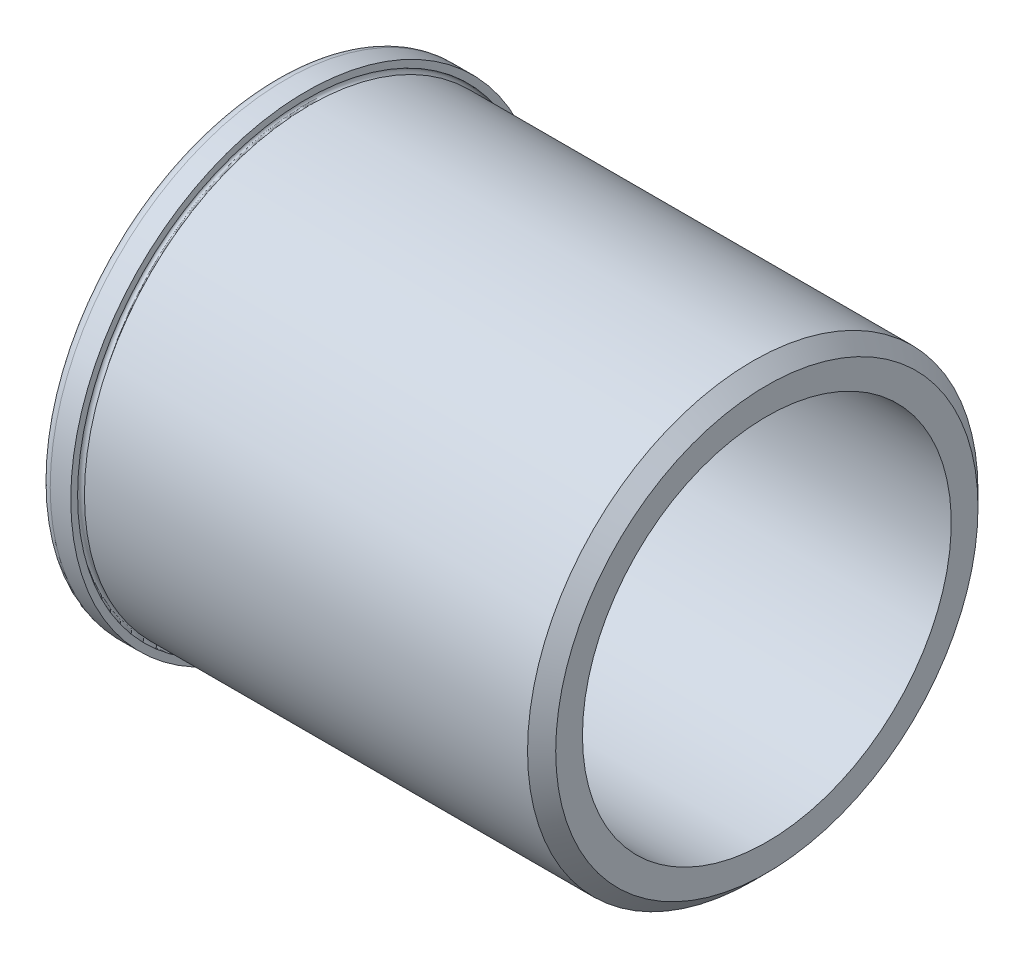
ISO-10303-21;
HEADER;
FILE_DESCRIPTION(('STEP AP214'),'2;1');
FILE_NAME('part.step','',(''),(''),'','','');
FILE_SCHEMA(('AUTOMOTIVE_DESIGN { 1 0 10303 214 1 1 1 1 }'));
ENDSEC;
DATA;
#1=APPLICATION_CONTEXT('core data for automotive mechanical design processes');
#2=APPLICATION_PROTOCOL_DEFINITION('international standard','automotive_design',2000,#1);
#3=PRODUCT_CONTEXT('',#1,'mechanical');
#4=PRODUCT('Part','Part','',(#3));
#5=PRODUCT_RELATED_PRODUCT_CATEGORY('part','',(#4));
#6=PRODUCT_DEFINITION_FORMATION('','',#4);
#7=PRODUCT_DEFINITION_CONTEXT('part definition',#1,'design');
#8=PRODUCT_DEFINITION('design','',#6,#7);
#9=PRODUCT_DEFINITION_SHAPE('','',#8);
#10=(LENGTH_UNIT() NAMED_UNIT(*) SI_UNIT(.MILLI.,.METRE.));
#11=(NAMED_UNIT(*) PLANE_ANGLE_UNIT() SI_UNIT($,.RADIAN.));
#12=(NAMED_UNIT(*) SI_UNIT($,.STERADIAN.) SOLID_ANGLE_UNIT());
#13=UNCERTAINTY_MEASURE_WITH_UNIT(LENGTH_MEASURE(1.E-05),#10,'distance_accuracy_value','');
#14=(GEOMETRIC_REPRESENTATION_CONTEXT(3) GLOBAL_UNCERTAINTY_ASSIGNED_CONTEXT((#13)) GLOBAL_UNIT_ASSIGNED_CONTEXT((#10,
#11,#12)) REPRESENTATION_CONTEXT('',''));
#15=CARTESIAN_POINT('',(0.,0.,0.));
#16=DIRECTION('',(0.,0.,1.));
#17=DIRECTION('',(1.,0.,0.));
#18=AXIS2_PLACEMENT_3D('',#15,#16,#17);
#19=CARTESIAN_POINT('',(4.7752,36.5125,0.));
#20=DIRECTION('',(1.,0.,0.));
#21=DIRECTION('',(0.,0.,-1.));
#22=AXIS2_PLACEMENT_3D('',#19,#20,#21);
#23=PLANE('',#22);
#24=CARTESIAN_POINT('',(4.7752,0.,0.));
#25=DIRECTION('',(-1.,0.,0.));
#26=DIRECTION('',(0.,0.,1.));
#27=AXIS2_PLACEMENT_3D('',#24,#25,#26);
#28=CIRCLE('',#27,35.4541666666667);
#29=CARTESIAN_POINT('',(4.7752,0.,35.4541666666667));
#30=VERTEX_POINT('',#29);
#31=EDGE_CURVE('E71',#30,#30,#28,.T.);
#32=ORIENTED_EDGE('',*,*,#31,.T.);
#33=EDGE_LOOP('',(#32));
#34=FACE_BOUND('',#33,.T.);
#35=CARTESIAN_POINT('',(4.7752,0.,0.));
#36=DIRECTION('',(-1.,0.,0.));
#37=DIRECTION('',(0.,0.,1.));
#38=AXIS2_PLACEMENT_3D('',#35,#36,#37);
#39=CIRCLE('',#38,36.5125);
#40=CARTESIAN_POINT('',(4.7752,0.,36.5125));
#41=VERTEX_POINT('',#40);
#42=EDGE_CURVE('E10',#41,#41,#39,.T.);
#43=ORIENTED_EDGE('',*,*,#42,.F.);
#44=EDGE_LOOP('',(#43));
#45=FACE_BOUND('',#44,.T.);
#46=ADVANCED_FACE('F37',(#34,#45),#23,.T.);
#47=CARTESIAN_POINT('',(0.,0.,0.));
#48=DIRECTION('',(-1.,0.,0.));
#49=DIRECTION('',(0.,0.,1.));
#50=AXIS2_PLACEMENT_3D('',#47,#48,#49);
#51=CYLINDRICAL_SURFACE('',#50,36.5125);
#52=ORIENTED_EDGE('',*,*,#42,.T.);
#53=EDGE_LOOP('',(#52));
#54=FACE_BOUND('',#53,.T.);
#55=CARTESIAN_POINT('',(1.58750000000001,0.,0.));
#56=DIRECTION('',(-1.,0.,0.));
#57=DIRECTION('',(0.,0.,1.));
#58=AXIS2_PLACEMENT_3D('',#55,#56,#57);
#59=CIRCLE('',#58,36.5125);
#60=CARTESIAN_POINT('',(1.58750000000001,0.,36.5125));
#61=VERTEX_POINT('',#60);
#62=EDGE_CURVE('E43',#61,#61,#59,.T.);
#63=ORIENTED_EDGE('',*,*,#62,.F.);
#64=EDGE_LOOP('',(#63));
#65=FACE_BOUND('',#64,.T.);
#66=ADVANCED_FACE('F89',(#54,#65),#51,.T.);
#67=CARTESIAN_POINT('',(1.5875,0.,0.));
#68=DIRECTION('',(-1.,0.,0.));
#69=DIRECTION('',(0.,0.,1.));
#70=AXIS2_PLACEMENT_3D('',#67,#68,#69);
#71=TOROIDAL_SURFACE('',#70,34.925,1.5875);
#72=CARTESIAN_POINT('',(0.,0.,0.));
#73=DIRECTION('',(-1.,0.,0.));
#74=DIRECTION('',(0.,0.,1.));
#75=AXIS2_PLACEMENT_3D('',#72,#73,#74);
#76=CIRCLE('',#75,34.925);
#77=CARTESIAN_POINT('',(0.,0.,34.925));
#78=VERTEX_POINT('',#77);
#79=EDGE_CURVE('E47',#78,#78,#76,.T.);
#80=ORIENTED_EDGE('',*,*,#79,.F.);
#81=EDGE_LOOP('',(#80));
#82=FACE_BOUND('',#81,.T.);
#83=ORIENTED_EDGE('',*,*,#62,.T.);
#84=EDGE_LOOP('',(#83));
#85=FACE_BOUND('',#84,.T.);
#86=ADVANCED_FACE('F93',(#82,#85),#71,.T.);
#87=CARTESIAN_POINT('',(0.,31.76905,0.));
#88=DIRECTION('',(-1.,0.,0.));
#89=DIRECTION('',(0.,0.,1.));
#90=AXIS2_PLACEMENT_3D('',#87,#88,#89);
#91=PLANE('',#90);
#92=ORIENTED_EDGE('',*,*,#79,.T.);
#93=EDGE_LOOP('',(#92));
#94=FACE_BOUND('',#93,.T.);
#95=CARTESIAN_POINT('',(0.,0.,0.));
#96=DIRECTION('',(-1.,0.,0.));
#97=DIRECTION('',(0.,0.,1.));
#98=AXIS2_PLACEMENT_3D('',#95,#96,#97);
#99=CIRCLE('',#98,31.76905);
#100=CARTESIAN_POINT('',(0.,0.,31.76905));
#101=VERTEX_POINT('',#100);
#102=EDGE_CURVE('E51',#101,#101,#99,.T.);
#103=ORIENTED_EDGE('',*,*,#102,.F.);
#104=EDGE_LOOP('',(#103));
#105=FACE_BOUND('',#104,.T.);
#106=ADVANCED_FACE('F97',(#94,#105),#91,.T.);
#107=CARTESIAN_POINT('',(3.175,0.,0.));
#108=DIRECTION('',(-1.,0.,0.));
#109=DIRECTION('',(0.,0.,1.));
#110=AXIS2_PLACEMENT_3D('',#107,#108,#109);
#111=TOROIDAL_SURFACE('',#110,31.76905,3.175);
#112=CARTESIAN_POINT('',(3.175,0.,0.));
#113=DIRECTION('',(-1.,0.,0.));
#114=DIRECTION('',(0.,0.,1.));
#115=AXIS2_PLACEMENT_3D('',#112,#113,#114);
#116=CIRCLE('',#115,28.59405);
#117=CARTESIAN_POINT('',(3.175,0.,28.59405));
#118=VERTEX_POINT('',#117);
#119=EDGE_CURVE('E56',#118,#118,#116,.T.);
#120=ORIENTED_EDGE('',*,*,#119,.F.);
#121=EDGE_LOOP('',(#120));
#122=FACE_BOUND('',#121,.T.);
#123=ORIENTED_EDGE('',*,*,#102,.T.);
#124=EDGE_LOOP('',(#123));
#125=FACE_BOUND('',#124,.T.);
#126=ADVANCED_FACE('F104',(#122,#125),#111,.T.);
#127=CARTESIAN_POINT('',(0.,0.,0.));
#128=DIRECTION('',(-1.,0.,0.));
#129=DIRECTION('',(0.,0.,1.));
#130=AXIS2_PLACEMENT_3D('',#127,#128,#129);
#131=CYLINDRICAL_SURFACE('',#130,28.59405);
#132=ORIENTED_EDGE('',*,*,#119,.T.);
#133=EDGE_LOOP('',(#132));
#134=FACE_BOUND('',#133,.T.);
#135=CARTESIAN_POINT('',(76.2,0.,0.));
#136=DIRECTION('',(-1.,0.,0.));
#137=DIRECTION('',(0.,0.,1.));
#138=AXIS2_PLACEMENT_3D('',#135,#136,#137);
#139=CIRCLE('',#138,28.59405);
#140=CARTESIAN_POINT('',(76.2,0.,28.59405));
#141=VERTEX_POINT('',#140);
#142=EDGE_CURVE('E59',#141,#141,#139,.T.);
#143=ORIENTED_EDGE('',*,*,#142,.F.);
#144=EDGE_LOOP('',(#143));
#145=FACE_BOUND('',#144,.T.);
#146=ADVANCED_FACE('F108',(#134,#145),#131,.F.);
#147=CARTESIAN_POINT('',(76.2,32.7421875,0.));
#148=DIRECTION('',(1.,0.,0.));
#149=DIRECTION('',(0.,0.,-1.));
#150=AXIS2_PLACEMENT_3D('',#147,#148,#149);
#151=PLANE('',#150);
#152=ORIENTED_EDGE('',*,*,#142,.T.);
#153=EDGE_LOOP('',(#152));
#154=FACE_BOUND('',#153,.T.);
#155=CARTESIAN_POINT('',(76.2,0.,0.));
#156=DIRECTION('',(-1.,0.,0.));
#157=DIRECTION('',(0.,0.,1.));
#158=AXIS2_PLACEMENT_3D('',#155,#156,#157);
#159=CIRCLE('',#158,32.7421875);
#160=CARTESIAN_POINT('',(76.2,0.,32.7421875));
#161=VERTEX_POINT('',#160);
#162=EDGE_CURVE('E62',#161,#161,#159,.T.);
#163=ORIENTED_EDGE('',*,*,#162,.F.);
#164=EDGE_LOOP('',(#163));
#165=FACE_BOUND('',#164,.T.);
#166=ADVANCED_FACE('F112',(#154,#165),#151,.T.);
#167=CARTESIAN_POINT('',(74.0171875,0.,0.));
#168=DIRECTION('',(-1.,0.,0.));
#169=DIRECTION('',(0.,0.,1.));
#170=AXIS2_PLACEMENT_3D('',#167,#168,#169);
#171=CONICAL_SURFACE('',#170,34.925,0.78539816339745);
#172=ORIENTED_EDGE('',*,*,#162,.T.);
#173=EDGE_LOOP('',(#172));
#174=FACE_BOUND('',#173,.T.);
#175=CARTESIAN_POINT('',(74.0171875,0.,0.));
#176=DIRECTION('',(-1.,0.,0.));
#177=DIRECTION('',(0.,0.,1.));
#178=AXIS2_PLACEMENT_3D('',#175,#176,#177);
#179=CIRCLE('',#178,34.925);
#180=CARTESIAN_POINT('',(74.0171875,0.,34.925));
#181=VERTEX_POINT('',#180);
#182=EDGE_CURVE('E65',#181,#181,#179,.T.);
#183=ORIENTED_EDGE('',*,*,#182,.F.);
#184=EDGE_LOOP('',(#183));
#185=FACE_BOUND('',#184,.T.);
#186=ADVANCED_FACE('F85',(#174,#185),#171,.T.);
#187=CARTESIAN_POINT('',(0.,0.,0.));
#188=DIRECTION('',(-1.,0.,0.));
#189=DIRECTION('',(0.,0.,1.));
#190=AXIS2_PLACEMENT_3D('',#187,#188,#189);
#191=CYLINDRICAL_SURFACE('',#190,34.925);
#192=ORIENTED_EDGE('',*,*,#182,.T.);
#193=EDGE_LOOP('',(#192));
#194=FACE_BOUND('',#193,.T.);
#195=CARTESIAN_POINT('',(5.30436666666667,0.,0.));
#196=DIRECTION('',(-1.,0.,0.));
#197=DIRECTION('',(0.,0.,1.));
#198=AXIS2_PLACEMENT_3D('',#195,#196,#197);
#199=CIRCLE('',#198,34.925);
#200=CARTESIAN_POINT('',(5.30436666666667,0.,34.925));
#201=VERTEX_POINT('',#200);
#202=EDGE_CURVE('E68',#201,#201,#199,.T.);
#203=ORIENTED_EDGE('',*,*,#202,.F.);
#204=EDGE_LOOP('',(#203));
#205=FACE_BOUND('',#204,.T.);
#206=ADVANCED_FACE('F79',(#194,#205),#191,.T.);
#207=CARTESIAN_POINT('',(4.7752,0.,0.));
#208=DIRECTION('',(-1.,0.,0.));
#209=DIRECTION('',(0.,0.,1.));
#210=AXIS2_PLACEMENT_3D('',#207,#208,#209);
#211=TOROIDAL_SURFACE('',#210,34.925,0.529166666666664);
#212=ORIENTED_EDGE('',*,*,#202,.T.);
#213=EDGE_LOOP('',(#212));
#214=FACE_BOUND('',#213,.T.);
#215=ORIENTED_EDGE('',*,*,#31,.F.);
#216=EDGE_LOOP('',(#215));
#217=FACE_BOUND('',#216,.T.);
#218=ADVANCED_FACE('F77',(#214,#217),#211,.F.);
#219=CLOSED_SHELL('',(#46,#66,#86,#106,#126,#146,#166,#186,#206,#218));
#220=MANIFOLD_SOLID_BREP('B2',#219);
#221=ADVANCED_BREP_SHAPE_REPRESENTATION('',(#18,#220),#14);
#222=SHAPE_DEFINITION_REPRESENTATION(#9,#221);
ENDSEC;
END-ISO-10303-21;
